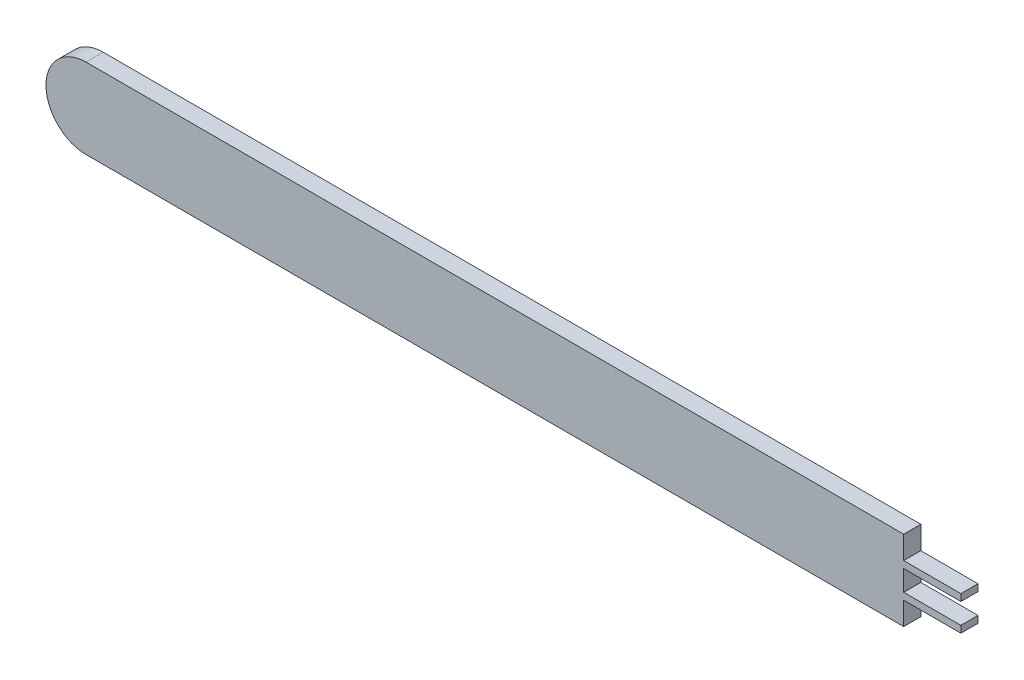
ISO-10303-21;
HEADER;
FILE_DESCRIPTION(('STEP AP214'),'2;1');
FILE_NAME('part.step','',(''),(''),'','','');
FILE_SCHEMA(('AUTOMOTIVE_DESIGN { 1 0 10303 214 1 1 1 1 }'));
ENDSEC;
DATA;
#1=APPLICATION_CONTEXT('core data for automotive mechanical design processes');
#2=APPLICATION_PROTOCOL_DEFINITION('international standard','automotive_design',2000,#1);
#3=PRODUCT_CONTEXT('',#1,'mechanical');
#4=PRODUCT('Part','Part','',(#3));
#5=PRODUCT_RELATED_PRODUCT_CATEGORY('part','',(#4));
#6=PRODUCT_DEFINITION_FORMATION('','',#4);
#7=PRODUCT_DEFINITION_CONTEXT('part definition',#1,'design');
#8=PRODUCT_DEFINITION('design','',#6,#7);
#9=PRODUCT_DEFINITION_SHAPE('','',#8);
#10=(LENGTH_UNIT() NAMED_UNIT(*) SI_UNIT(.MILLI.,.METRE.));
#11=(NAMED_UNIT(*) PLANE_ANGLE_UNIT() SI_UNIT($,.RADIAN.));
#12=(NAMED_UNIT(*) SI_UNIT($,.STERADIAN.) SOLID_ANGLE_UNIT());
#13=UNCERTAINTY_MEASURE_WITH_UNIT(LENGTH_MEASURE(1.E-05),#10,'distance_accuracy_value','');
#14=(GEOMETRIC_REPRESENTATION_CONTEXT(3) GLOBAL_UNCERTAINTY_ASSIGNED_CONTEXT((#13)) GLOBAL_UNIT_ASSIGNED_CONTEXT((#10,
#11,#12)) REPRESENTATION_CONTEXT('',''));
#15=CARTESIAN_POINT('',(0.,0.,0.));
#16=DIRECTION('',(0.,0.,1.));
#17=DIRECTION('',(1.,0.,0.));
#18=AXIS2_PLACEMENT_3D('',#15,#16,#17);
#19=CARTESIAN_POINT('',(0.,-7.,1.5));
#20=DIRECTION('',(0.,1.,0.));
#21=DIRECTION('',(0.,0.,1.));
#22=AXIS2_PLACEMENT_3D('',#19,#20,#21);
#23=PLANE('',#22);
#24=DIRECTION('',(1.,0.,0.));
#25=VECTOR('',#24,1.);
#26=CARTESIAN_POINT('',(0.,-7.,1.5));
#27=LINE('',#26,#25);
#28=CARTESIAN_POINT('',(3.5,-7.,1.5));
#29=VERTEX_POINT('',#28);
#30=CARTESIAN_POINT('',(75.,-7.,1.5));
#31=VERTEX_POINT('',#30);
#32=EDGE_CURVE('E122',#29,#31,#27,.T.);
#33=ORIENTED_EDGE('',*,*,#32,.F.);
#34=DIRECTION('',(0.,0.,-1.));
#35=VECTOR('',#34,1.);
#36=CARTESIAN_POINT('',(3.5,-7.,1.5));
#37=LINE('',#36,#35);
#38=CARTESIAN_POINT('',(3.5,-7.,0.));
#39=VERTEX_POINT('',#38);
#40=EDGE_CURVE('E11',#29,#39,#37,.T.);
#41=ORIENTED_EDGE('',*,*,#40,.T.);
#42=DIRECTION('',(1.,0.,0.));
#43=VECTOR('',#42,1.);
#44=CARTESIAN_POINT('',(0.,-7.,0.));
#45=LINE('',#44,#43);
#46=CARTESIAN_POINT('',(75.,-7.,0.));
#47=VERTEX_POINT('',#46);
#48=EDGE_CURVE('E135',#39,#47,#45,.T.);
#49=ORIENTED_EDGE('',*,*,#48,.T.);
#50=DIRECTION('',(0.,0.,-1.));
#51=VECTOR('',#50,1.);
#52=CARTESIAN_POINT('',(75.,-7.,1.5));
#53=LINE('',#52,#51);
#54=EDGE_CURVE('E133',#31,#47,#53,.T.);
#55=ORIENTED_EDGE('',*,*,#54,.F.);
#56=EDGE_LOOP('',(#33,#41,#49,#55));
#57=FACE_BOUND('',#56,.T.);
#58=ADVANCED_FACE('F33',(#57),#23,.F.);
#59=CARTESIAN_POINT('',(75.,-5.,1.5));
#60=DIRECTION('',(-1.,0.,0.));
#61=DIRECTION('',(0.,0.,1.));
#62=AXIS2_PLACEMENT_3D('',#59,#60,#61);
#63=PLANE('',#62);
#64=DIRECTION('',(0.,1.,0.));
#65=VECTOR('',#64,1.);
#66=CARTESIAN_POINT('',(75.,-5.,0.));
#67=LINE('',#66,#65);
#68=CARTESIAN_POINT('',(75.,-5.,0.));
#69=VERTEX_POINT('',#68);
#70=EDGE_CURVE('E166',#47,#69,#67,.T.);
#71=ORIENTED_EDGE('',*,*,#70,.T.);
#72=DIRECTION('',(0.,0.,-1.));
#73=VECTOR('',#72,1.);
#74=CARTESIAN_POINT('',(75.,-5.,1.5));
#75=LINE('',#74,#73);
#76=CARTESIAN_POINT('',(75.,-5.,1.5));
#77=VERTEX_POINT('',#76);
#78=EDGE_CURVE('E139',#77,#69,#75,.T.);
#79=ORIENTED_EDGE('',*,*,#78,.F.);
#80=DIRECTION('',(0.,1.,0.));
#81=VECTOR('',#80,1.);
#82=CARTESIAN_POINT('',(75.,-5.,1.5));
#83=LINE('',#82,#81);
#84=EDGE_CURVE('E126',#31,#77,#83,.T.);
#85=ORIENTED_EDGE('',*,*,#84,.F.);
#86=ORIENTED_EDGE('',*,*,#54,.T.);
#87=EDGE_LOOP('',(#71,#79,#85,#86));
#88=FACE_BOUND('',#87,.T.);
#89=ADVANCED_FACE('F141',(#88),#63,.F.);
#90=CARTESIAN_POINT('',(75.,-5.,1.5));
#91=DIRECTION('',(0.,1.,0.));
#92=DIRECTION('',(0.,0.,1.));
#93=AXIS2_PLACEMENT_3D('',#90,#91,#92);
#94=PLANE('',#93);
#95=DIRECTION('',(1.,0.,0.));
#96=VECTOR('',#95,1.);
#97=CARTESIAN_POINT('',(75.,-5.,0.));
#98=LINE('',#97,#96);
#99=CARTESIAN_POINT('',(80.,-5.,0.));
#100=VERTEX_POINT('',#99);
#101=EDGE_CURVE('E168',#69,#100,#98,.T.);
#102=ORIENTED_EDGE('',*,*,#101,.T.);
#103=DIRECTION('',(0.,0.,-1.));
#104=VECTOR('',#103,1.);
#105=CARTESIAN_POINT('',(80.,-5.,1.5));
#106=LINE('',#105,#104);
#107=CARTESIAN_POINT('',(80.,-5.,1.5));
#108=VERTEX_POINT('',#107);
#109=EDGE_CURVE('E206',#108,#100,#106,.T.);
#110=ORIENTED_EDGE('',*,*,#109,.F.);
#111=DIRECTION('',(1.,0.,0.));
#112=VECTOR('',#111,1.);
#113=CARTESIAN_POINT('',(75.,-5.,1.5));
#114=LINE('',#113,#112);
#115=EDGE_CURVE('E144',#77,#108,#114,.T.);
#116=ORIENTED_EDGE('',*,*,#115,.F.);
#117=ORIENTED_EDGE('',*,*,#78,.T.);
#118=EDGE_LOOP('',(#102,#110,#116,#117));
#119=FACE_BOUND('',#118,.T.);
#120=ADVANCED_FACE('F242',(#119),#94,.F.);
#121=CARTESIAN_POINT('',(80.,-4.4,1.5));
#122=DIRECTION('',(-1.,0.,0.));
#123=DIRECTION('',(0.,0.,1.));
#124=AXIS2_PLACEMENT_3D('',#121,#122,#123);
#125=PLANE('',#124);
#126=DIRECTION('',(0.,1.,0.));
#127=VECTOR('',#126,1.);
#128=CARTESIAN_POINT('',(80.,-4.4,0.));
#129=LINE('',#128,#127);
#130=CARTESIAN_POINT('',(80.,-4.4,0.));
#131=VERTEX_POINT('',#130);
#132=EDGE_CURVE('E170',#100,#131,#129,.T.);
#133=ORIENTED_EDGE('',*,*,#132,.T.);
#134=DIRECTION('',(0.,0.,-1.));
#135=VECTOR('',#134,1.);
#136=CARTESIAN_POINT('',(80.,-4.4,1.5));
#137=LINE('',#136,#135);
#138=CARTESIAN_POINT('',(80.,-4.4,1.5));
#139=VERTEX_POINT('',#138);
#140=EDGE_CURVE('E203',#139,#131,#137,.T.);
#141=ORIENTED_EDGE('',*,*,#140,.F.);
#142=DIRECTION('',(0.,1.,0.));
#143=VECTOR('',#142,1.);
#144=CARTESIAN_POINT('',(80.,-4.4,1.5));
#145=LINE('',#144,#143);
#146=EDGE_CURVE('E146',#108,#139,#145,.T.);
#147=ORIENTED_EDGE('',*,*,#146,.F.);
#148=ORIENTED_EDGE('',*,*,#109,.T.);
#149=EDGE_LOOP('',(#133,#141,#147,#148));
#150=FACE_BOUND('',#149,.T.);
#151=ADVANCED_FACE('F249',(#150),#125,.F.);
#152=CARTESIAN_POINT('',(75.,-4.4,1.5));
#153=DIRECTION('',(0.,-1.,0.));
#154=DIRECTION('',(1.,0.,0.));
#155=AXIS2_PLACEMENT_3D('',#152,#153,#154);
#156=PLANE('',#155);
#157=DIRECTION('',(-1.,0.,0.));
#158=VECTOR('',#157,1.);
#159=CARTESIAN_POINT('',(75.,-4.4,0.));
#160=LINE('',#159,#158);
#161=CARTESIAN_POINT('',(75.,-4.4,0.));
#162=VERTEX_POINT('',#161);
#163=EDGE_CURVE('E172',#131,#162,#160,.T.);
#164=ORIENTED_EDGE('',*,*,#163,.T.);
#165=DIRECTION('',(0.,0.,-1.));
#166=VECTOR('',#165,1.);
#167=CARTESIAN_POINT('',(75.,-4.4,1.5));
#168=LINE('',#167,#166);
#169=CARTESIAN_POINT('',(75.,-4.4,1.5));
#170=VERTEX_POINT('',#169);
#171=EDGE_CURVE('E200',#170,#162,#168,.T.);
#172=ORIENTED_EDGE('',*,*,#171,.F.);
#173=DIRECTION('',(-1.,0.,0.));
#174=VECTOR('',#173,1.);
#175=CARTESIAN_POINT('',(75.,-4.4,1.5));
#176=LINE('',#175,#174);
#177=EDGE_CURVE('E150',#139,#170,#176,.T.);
#178=ORIENTED_EDGE('',*,*,#177,.F.);
#179=ORIENTED_EDGE('',*,*,#140,.T.);
#180=EDGE_LOOP('',(#164,#172,#178,#179));
#181=FACE_BOUND('',#180,.T.);
#182=ADVANCED_FACE('F252',(#181),#156,.F.);
#183=CARTESIAN_POINT('',(75.,-2.6,1.5));
#184=DIRECTION('',(-1.,0.,0.));
#185=DIRECTION('',(0.,0.,1.));
#186=AXIS2_PLACEMENT_3D('',#183,#184,#185);
#187=PLANE('',#186);
#188=DIRECTION('',(0.,1.,0.));
#189=VECTOR('',#188,1.);
#190=CARTESIAN_POINT('',(75.,-2.6,0.));
#191=LINE('',#190,#189);
#192=CARTESIAN_POINT('',(75.,-2.6,0.));
#193=VERTEX_POINT('',#192);
#194=EDGE_CURVE('E174',#162,#193,#191,.T.);
#195=ORIENTED_EDGE('',*,*,#194,.T.);
#196=DIRECTION('',(0.,0.,-1.));
#197=VECTOR('',#196,1.);
#198=CARTESIAN_POINT('',(75.,-2.6,1.5));
#199=LINE('',#198,#197);
#200=CARTESIAN_POINT('',(75.,-2.6,1.5));
#201=VERTEX_POINT('',#200);
#202=EDGE_CURVE('E197',#201,#193,#199,.T.);
#203=ORIENTED_EDGE('',*,*,#202,.F.);
#204=DIRECTION('',(0.,1.,0.));
#205=VECTOR('',#204,1.);
#206=CARTESIAN_POINT('',(75.,-2.6,1.5));
#207=LINE('',#206,#205);
#208=EDGE_CURVE('E152',#170,#201,#207,.T.);
#209=ORIENTED_EDGE('',*,*,#208,.F.);
#210=ORIENTED_EDGE('',*,*,#171,.T.);
#211=EDGE_LOOP('',(#195,#203,#209,#210));
#212=FACE_BOUND('',#211,.T.);
#213=ADVANCED_FACE('F257',(#212),#187,.F.);
#214=CARTESIAN_POINT('',(75.,-2.6,1.5));
#215=DIRECTION('',(0.,1.,0.));
#216=DIRECTION('',(0.,0.,1.));
#217=AXIS2_PLACEMENT_3D('',#214,#215,#216);
#218=PLANE('',#217);
#219=DIRECTION('',(1.,0.,0.));
#220=VECTOR('',#219,1.);
#221=CARTESIAN_POINT('',(75.,-2.6,0.));
#222=LINE('',#221,#220);
#223=CARTESIAN_POINT('',(80.,-2.6,0.));
#224=VERTEX_POINT('',#223);
#225=EDGE_CURVE('E176',#193,#224,#222,.T.);
#226=ORIENTED_EDGE('',*,*,#225,.T.);
#227=DIRECTION('',(0.,0.,-1.));
#228=VECTOR('',#227,1.);
#229=CARTESIAN_POINT('',(80.,-2.6,1.5));
#230=LINE('',#229,#228);
#231=CARTESIAN_POINT('',(80.,-2.6,1.5));
#232=VERTEX_POINT('',#231);
#233=EDGE_CURVE('E194',#232,#224,#230,.T.);
#234=ORIENTED_EDGE('',*,*,#233,.F.);
#235=DIRECTION('',(1.,0.,0.));
#236=VECTOR('',#235,1.);
#237=CARTESIAN_POINT('',(75.,-2.6,1.5));
#238=LINE('',#237,#236);
#239=EDGE_CURVE('E154',#201,#232,#238,.T.);
#240=ORIENTED_EDGE('',*,*,#239,.F.);
#241=ORIENTED_EDGE('',*,*,#202,.T.);
#242=EDGE_LOOP('',(#226,#234,#240,#241));
#243=FACE_BOUND('',#242,.T.);
#244=ADVANCED_FACE('F263',(#243),#218,.F.);
#245=CARTESIAN_POINT('',(80.,-2.,1.5));
#246=DIRECTION('',(-1.,0.,0.));
#247=DIRECTION('',(0.,0.,1.));
#248=AXIS2_PLACEMENT_3D('',#245,#246,#247);
#249=PLANE('',#248);
#250=DIRECTION('',(0.,1.,0.));
#251=VECTOR('',#250,1.);
#252=CARTESIAN_POINT('',(80.,-2.,0.));
#253=LINE('',#252,#251);
#254=CARTESIAN_POINT('',(80.,-2.,0.));
#255=VERTEX_POINT('',#254);
#256=EDGE_CURVE('E178',#224,#255,#253,.T.);
#257=ORIENTED_EDGE('',*,*,#256,.T.);
#258=DIRECTION('',(0.,0.,-1.));
#259=VECTOR('',#258,1.);
#260=CARTESIAN_POINT('',(80.,-2.,1.5));
#261=LINE('',#260,#259);
#262=CARTESIAN_POINT('',(80.,-2.,1.5));
#263=VERTEX_POINT('',#262);
#264=EDGE_CURVE('E191',#263,#255,#261,.T.);
#265=ORIENTED_EDGE('',*,*,#264,.F.);
#266=DIRECTION('',(0.,1.,0.));
#267=VECTOR('',#266,1.);
#268=CARTESIAN_POINT('',(80.,-2.,1.5));
#269=LINE('',#268,#267);
#270=EDGE_CURVE('E156',#232,#263,#269,.T.);
#271=ORIENTED_EDGE('',*,*,#270,.F.);
#272=ORIENTED_EDGE('',*,*,#233,.T.);
#273=EDGE_LOOP('',(#257,#265,#271,#272));
#274=FACE_BOUND('',#273,.T.);
#275=ADVANCED_FACE('F267',(#274),#249,.F.);
#276=CARTESIAN_POINT('',(75.,-2.,1.5));
#277=DIRECTION('',(0.,-1.,0.));
#278=DIRECTION('',(0.,0.,-1.));
#279=AXIS2_PLACEMENT_3D('',#276,#277,#278);
#280=PLANE('',#279);
#281=DIRECTION('',(-1.,0.,0.));
#282=VECTOR('',#281,1.);
#283=CARTESIAN_POINT('',(75.,-2.,0.));
#284=LINE('',#283,#282);
#285=CARTESIAN_POINT('',(75.,-2.,0.));
#286=VERTEX_POINT('',#285);
#287=EDGE_CURVE('E180',#255,#286,#284,.T.);
#288=ORIENTED_EDGE('',*,*,#287,.T.);
#289=DIRECTION('',(0.,0.,-1.));
#290=VECTOR('',#289,1.);
#291=CARTESIAN_POINT('',(75.,-2.,1.5));
#292=LINE('',#291,#290);
#293=CARTESIAN_POINT('',(75.,-2.,1.5));
#294=VERTEX_POINT('',#293);
#295=EDGE_CURVE('E188',#294,#286,#292,.T.);
#296=ORIENTED_EDGE('',*,*,#295,.F.);
#297=DIRECTION('',(-1.,0.,0.));
#298=VECTOR('',#297,1.);
#299=CARTESIAN_POINT('',(75.,-2.,1.5));
#300=LINE('',#299,#298);
#301=EDGE_CURVE('E158',#263,#294,#300,.T.);
#302=ORIENTED_EDGE('',*,*,#301,.F.);
#303=ORIENTED_EDGE('',*,*,#264,.T.);
#304=EDGE_LOOP('',(#288,#296,#302,#303));
#305=FACE_BOUND('',#304,.T.);
#306=ADVANCED_FACE('F269',(#305),#280,.F.);
#307=CARTESIAN_POINT('',(75.,0.,1.5));
#308=DIRECTION('',(-1.,0.,0.));
#309=DIRECTION('',(0.,0.,1.));
#310=AXIS2_PLACEMENT_3D('',#307,#308,#309);
#311=PLANE('',#310);
#312=DIRECTION('',(0.,1.,0.));
#313=VECTOR('',#312,1.);
#314=CARTESIAN_POINT('',(75.,0.,0.));
#315=LINE('',#314,#313);
#316=CARTESIAN_POINT('',(75.,0.,0.));
#317=VERTEX_POINT('',#316);
#318=EDGE_CURVE('E182',#286,#317,#315,.T.);
#319=ORIENTED_EDGE('',*,*,#318,.T.);
#320=DIRECTION('',(0.,0.,-1.));
#321=VECTOR('',#320,1.);
#322=CARTESIAN_POINT('',(75.,0.,1.5));
#323=LINE('',#322,#321);
#324=CARTESIAN_POINT('',(75.,0.,1.5));
#325=VERTEX_POINT('',#324);
#326=EDGE_CURVE('E164',#325,#317,#323,.T.);
#327=ORIENTED_EDGE('',*,*,#326,.F.);
#328=DIRECTION('',(0.,1.,0.));
#329=VECTOR('',#328,1.);
#330=CARTESIAN_POINT('',(75.,0.,1.5));
#331=LINE('',#330,#329);
#332=EDGE_CURVE('E160',#294,#325,#331,.T.);
#333=ORIENTED_EDGE('',*,*,#332,.F.);
#334=ORIENTED_EDGE('',*,*,#295,.T.);
#335=EDGE_LOOP('',(#319,#327,#333,#334));
#336=FACE_BOUND('',#335,.T.);
#337=ADVANCED_FACE('F229',(#336),#311,.F.);
#338=CARTESIAN_POINT('',(0.,0.,1.5));
#339=DIRECTION('',(0.,-1.,0.));
#340=DIRECTION('',(0.,0.,-1.));
#341=AXIS2_PLACEMENT_3D('',#338,#339,#340);
#342=PLANE('',#341);
#343=DIRECTION('',(-1.,0.,0.));
#344=VECTOR('',#343,1.);
#345=CARTESIAN_POINT('',(0.,0.,0.));
#346=LINE('',#345,#344);
#347=CARTESIAN_POINT('',(3.5,0.,0.));
#348=VERTEX_POINT('',#347);
#349=EDGE_CURVE('E130',#317,#348,#346,.T.);
#350=ORIENTED_EDGE('',*,*,#349,.T.);
#351=DIRECTION('',(0.,0.,-1.));
#352=VECTOR('',#351,1.);
#353=CARTESIAN_POINT('',(3.5,0.,1.5));
#354=LINE('',#353,#352);
#355=CARTESIAN_POINT('',(3.5,0.,1.5));
#356=VERTEX_POINT('',#355);
#357=EDGE_CURVE('E213',#348,#356,#354,.F.);
#358=ORIENTED_EDGE('',*,*,#357,.T.);
#359=DIRECTION('',(-1.,0.,0.));
#360=VECTOR('',#359,1.);
#361=CARTESIAN_POINT('',(0.,0.,1.5));
#362=LINE('',#361,#360);
#363=EDGE_CURVE('E162',#325,#356,#362,.T.);
#364=ORIENTED_EDGE('',*,*,#363,.F.);
#365=ORIENTED_EDGE('',*,*,#326,.T.);
#366=EDGE_LOOP('',(#350,#358,#364,#365));
#367=FACE_BOUND('',#366,.T.);
#368=ADVANCED_FACE('F220',(#367),#342,.F.);
#369=CARTESIAN_POINT('',(0.,0.,1.5));
#370=DIRECTION('',(0.,0.,1.));
#371=DIRECTION('',(1.,0.,0.));
#372=AXIS2_PLACEMENT_3D('',#369,#370,#371);
#373=PLANE('',#372);
#374=ORIENTED_EDGE('',*,*,#363,.T.);
#375=CARTESIAN_POINT('',(3.5,-3.5,1.5));
#376=DIRECTION('',(0.,0.,1.));
#377=DIRECTION('',(1.,0.,0.));
#378=AXIS2_PLACEMENT_3D('',#375,#376,#377);
#379=CIRCLE('',#378,3.5);
#380=CARTESIAN_POINT('',(0.,-3.5,1.5));
#381=VERTEX_POINT('',#380);
#382=EDGE_CURVE('E42',#356,#381,#379,.T.);
#383=ORIENTED_EDGE('',*,*,#382,.T.);
#384=CARTESIAN_POINT('',(3.5,-3.5,1.5));
#385=DIRECTION('',(0.,0.,1.));
#386=DIRECTION('',(1.,0.,0.));
#387=AXIS2_PLACEMENT_3D('',#384,#385,#386);
#388=CIRCLE('',#387,3.5);
#389=EDGE_CURVE('E49',#381,#29,#388,.T.);
#390=ORIENTED_EDGE('',*,*,#389,.T.);
#391=ORIENTED_EDGE('',*,*,#32,.T.);
#392=ORIENTED_EDGE('',*,*,#84,.T.);
#393=ORIENTED_EDGE('',*,*,#115,.T.);
#394=ORIENTED_EDGE('',*,*,#146,.T.);
#395=ORIENTED_EDGE('',*,*,#177,.T.);
#396=ORIENTED_EDGE('',*,*,#208,.T.);
#397=ORIENTED_EDGE('',*,*,#239,.T.);
#398=ORIENTED_EDGE('',*,*,#270,.T.);
#399=ORIENTED_EDGE('',*,*,#301,.T.);
#400=ORIENTED_EDGE('',*,*,#332,.T.);
#401=EDGE_LOOP('',(#374,#383,#390,#391,#392,#393,#394,#395,#396,#397,#398,#399,#400));
#402=FACE_BOUND('',#401,.T.);
#403=ADVANCED_FACE('F124',(#402),#373,.T.);
#404=CARTESIAN_POINT('',(0.,0.,0.));
#405=DIRECTION('',(0.,0.,1.));
#406=DIRECTION('',(1.,0.,0.));
#407=AXIS2_PLACEMENT_3D('',#404,#405,#406);
#408=PLANE('',#407);
#409=CARTESIAN_POINT('',(3.5,-3.5,0.));
#410=DIRECTION('',(0.,0.,1.));
#411=DIRECTION('',(1.,0.,0.));
#412=AXIS2_PLACEMENT_3D('',#409,#410,#411);
#413=CIRCLE('',#412,3.5);
#414=CARTESIAN_POINT('',(0.,-3.5,0.));
#415=VERTEX_POINT('',#414);
#416=EDGE_CURVE('E138',#39,#415,#413,.F.);
#417=ORIENTED_EDGE('',*,*,#416,.T.);
#418=CARTESIAN_POINT('',(3.5,-3.5,0.));
#419=DIRECTION('',(0.,0.,1.));
#420=DIRECTION('',(1.,0.,0.));
#421=AXIS2_PLACEMENT_3D('',#418,#419,#420);
#422=CIRCLE('',#421,3.5);
#423=EDGE_CURVE('E211',#415,#348,#422,.F.);
#424=ORIENTED_EDGE('',*,*,#423,.T.);
#425=ORIENTED_EDGE('',*,*,#349,.F.);
#426=ORIENTED_EDGE('',*,*,#318,.F.);
#427=ORIENTED_EDGE('',*,*,#287,.F.);
#428=ORIENTED_EDGE('',*,*,#256,.F.);
#429=ORIENTED_EDGE('',*,*,#225,.F.);
#430=ORIENTED_EDGE('',*,*,#194,.F.);
#431=ORIENTED_EDGE('',*,*,#163,.F.);
#432=ORIENTED_EDGE('',*,*,#132,.F.);
#433=ORIENTED_EDGE('',*,*,#101,.F.);
#434=ORIENTED_EDGE('',*,*,#70,.F.);
#435=ORIENTED_EDGE('',*,*,#48,.F.);
#436=EDGE_LOOP('',(#417,#424,#425,#426,#427,#428,#429,#430,#431,#432,#433,#434,#435));
#437=FACE_BOUND('',#436,.T.);
#438=ADVANCED_FACE('F232',(#437),#408,.F.);
#439=CARTESIAN_POINT('',(3.5,-3.5,1.5));
#440=DIRECTION('',(0.,0.,-1.));
#441=DIRECTION('',(-1.,0.,0.));
#442=AXIS2_PLACEMENT_3D('',#439,#440,#441);
#443=CYLINDRICAL_SURFACE('',#442,3.5);
#444=ORIENTED_EDGE('',*,*,#40,.F.);
#445=ORIENTED_EDGE('',*,*,#389,.F.);
#446=DIRECTION('',(0.,0.,-1.));
#447=VECTOR('',#446,1.);
#448=CARTESIAN_POINT('',(0.,-3.5,1.5));
#449=LINE('',#448,#447);
#450=EDGE_CURVE('E37',#415,#381,#449,.F.);
#451=ORIENTED_EDGE('',*,*,#450,.F.);
#452=ORIENTED_EDGE('',*,*,#416,.F.);
#453=EDGE_LOOP('',(#444,#445,#451,#452));
#454=FACE_BOUND('',#453,.T.);
#455=ADVANCED_FACE('F35',(#454),#443,.T.);
#456=CARTESIAN_POINT('',(3.5,-3.5,1.5));
#457=DIRECTION('',(0.,0.,-1.));
#458=DIRECTION('',(-1.,0.,0.));
#459=AXIS2_PLACEMENT_3D('',#456,#457,#458);
#460=CYLINDRICAL_SURFACE('',#459,3.5);
#461=ORIENTED_EDGE('',*,*,#382,.F.);
#462=ORIENTED_EDGE('',*,*,#357,.F.);
#463=ORIENTED_EDGE('',*,*,#423,.F.);
#464=ORIENTED_EDGE('',*,*,#450,.T.);
#465=EDGE_LOOP('',(#461,#462,#463,#464));
#466=FACE_BOUND('',#465,.T.);
#467=ADVANCED_FACE('F237',(#466),#460,.T.);
#468=CLOSED_SHELL('',(#58,#89,#120,#151,#182,#213,#244,#275,#306,#337,#368,#403,#438,#455,#467));
#469=MANIFOLD_SOLID_BREP('B2',#468);
#470=ADVANCED_BREP_SHAPE_REPRESENTATION('',(#18,#469),#14);
#471=SHAPE_DEFINITION_REPRESENTATION(#9,#470);
ENDSEC;
END-ISO-10303-21;
